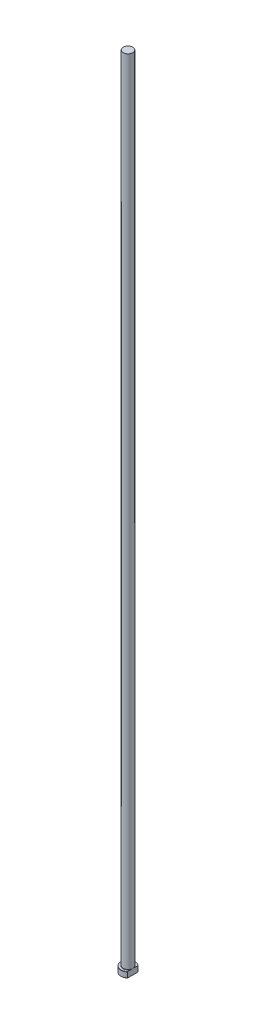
from build123d import *
from build123d.topology import SkipClean

# Parameters (mm, degrees)
CHAMFER1_SIZE = 0.2
FILLET1_R     = 0.3
KEY_DEPTH     = 1001.08099672


with BuildPart() as part:
    # Sketch1 → Revolve1 (revolve)
    with BuildSketch(Plane.XY, mode=Mode.PRIVATE) as revolve1_sk:
        Polygon((0, 0), (-9, 0), (-9, 7), (-6, 7), (-6, 1000), (0, 1000), align=None)
    revolve(revolve1_sk.sketch.rotate(Axis((0, 259.958771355, 0), (0, -1, 0)), 270), axis=Axis((0, 259.958771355, 0), (0, -1, 0)))

    # Chamfer1
    chamfer1_edges = [part.edges().sort_by_distance(p)[0] for p in [
        (0, 7, -9),
        (0, 0, -9),
    ]]
    chamfer(chamfer1_edges, length=CHAMFER1_SIZE)

    # Fillet1
    fillet1_edges = [part.edges().sort_by_distance(p)[0] for p in [
        (0, 7, -6),
    ]]
    fillet(fillet1_edges, radius=FILLET1_R)

    # Sketch2 → KEY (cut, through all)
    with SkipClean():  # the faces are left unmerged after this step: merging them gives an invalid solid
        with BuildSketch(Plane(origin=(0, 0, 0), x_dir=(1, 0, 0), z_dir=(0, 1, 0))):
            with BuildLine():
                Line((6, 6.708203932), (6, -6.708203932))
                ThreePointArc((6, -6.708203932), (9, 0), (6, 6.708203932))
            make_face()
        extrude(amount=KEY_DEPTH, mode=Mode.SUBTRACT)


solid = part.part
